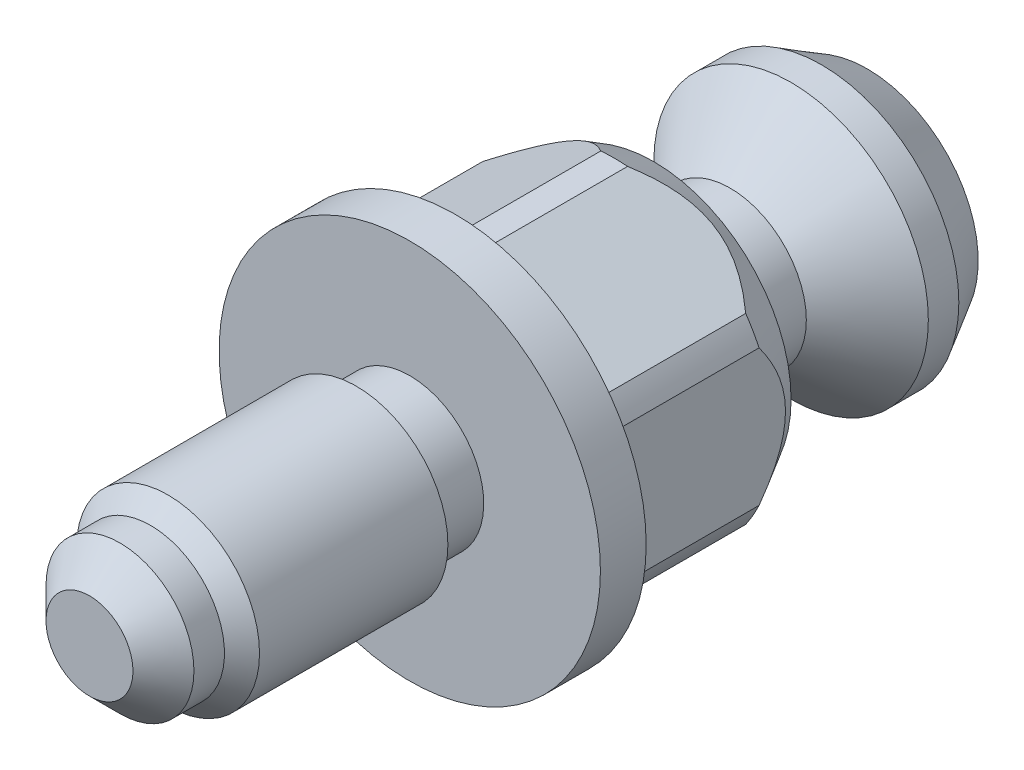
ISO-10303-21;
HEADER;
FILE_DESCRIPTION(('STEP AP214'),'2;1');
FILE_NAME('part.step','',(''),(''),'','','');
FILE_SCHEMA(('AUTOMOTIVE_DESIGN { 1 0 10303 214 1 1 1 1 }'));
ENDSEC;
DATA;
#1=APPLICATION_CONTEXT('core data for automotive mechanical design processes');
#2=APPLICATION_PROTOCOL_DEFINITION('international standard','automotive_design',2000,#1);
#3=PRODUCT_CONTEXT('',#1,'mechanical');
#4=PRODUCT('Part','Part','',(#3));
#5=PRODUCT_RELATED_PRODUCT_CATEGORY('part','',(#4));
#6=PRODUCT_DEFINITION_FORMATION('','',#4);
#7=PRODUCT_DEFINITION_CONTEXT('part definition',#1,'design');
#8=PRODUCT_DEFINITION('design','',#6,#7);
#9=PRODUCT_DEFINITION_SHAPE('','',#8);
#10=(LENGTH_UNIT() NAMED_UNIT(*) SI_UNIT(.MILLI.,.METRE.));
#11=(NAMED_UNIT(*) PLANE_ANGLE_UNIT() SI_UNIT($,.RADIAN.));
#12=(NAMED_UNIT(*) SI_UNIT($,.STERADIAN.) SOLID_ANGLE_UNIT());
#13=UNCERTAINTY_MEASURE_WITH_UNIT(LENGTH_MEASURE(1.E-05),#10,'distance_accuracy_value','');
#14=(GEOMETRIC_REPRESENTATION_CONTEXT(3) GLOBAL_UNCERTAINTY_ASSIGNED_CONTEXT((#13)) GLOBAL_UNIT_ASSIGNED_CONTEXT((#10,
#11,#12)) REPRESENTATION_CONTEXT('',''));
#15=CARTESIAN_POINT('',(0.,0.,0.));
#16=DIRECTION('',(0.,0.,1.));
#17=DIRECTION('',(1.,0.,0.));
#18=AXIS2_PLACEMENT_3D('',#15,#16,#17);
#19=CARTESIAN_POINT('',(0.,7.267949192,-30.));
#20=DIRECTION('',(0.,0.,-1.));
#21=DIRECTION('',(-1.,0.,0.));
#22=AXIS2_PLACEMENT_3D('',#19,#20,#21);
#23=PLANE('',#22);
#24=CARTESIAN_POINT('',(0.,0.,-30.));
#25=DIRECTION('',(0.,0.,1.));
#26=DIRECTION('',(0.,1.,0.));
#27=AXIS2_PLACEMENT_3D('',#24,#25,#26);
#28=CIRCLE('',#27,7.26794919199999);
#29=CARTESIAN_POINT('',(0.,7.26794919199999,-30.));
#30=VERTEX_POINT('',#29);
#31=EDGE_CURVE('E18',#30,#30,#28,.T.);
#32=ORIENTED_EDGE('',*,*,#31,.F.);
#33=EDGE_LOOP('',(#32));
#34=FACE_BOUND('',#33,.T.);
#35=ADVANCED_FACE('F14',(#34),#23,.T.);
#36=CARTESIAN_POINT('',(0.,0.,-27.));
#37=DIRECTION('',(0.,0.,1.));
#38=DIRECTION('',(0.,1.,0.));
#39=AXIS2_PLACEMENT_3D('',#36,#37,#38);
#40=CONICAL_SURFACE('',#39,9.,0.52359877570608);
#41=ORIENTED_EDGE('',*,*,#31,.T.);
#42=EDGE_LOOP('',(#41));
#43=FACE_BOUND('',#42,.T.);
#44=CARTESIAN_POINT('',(0.,0.,-27.));
#45=DIRECTION('',(0.,0.,1.));
#46=DIRECTION('',(1.,0.,0.));
#47=AXIS2_PLACEMENT_3D('',#44,#45,#46);
#48=CIRCLE('',#47,9.);
#49=CARTESIAN_POINT('',(9.,0.,-27.));
#50=VERTEX_POINT('',#49);
#51=EDGE_CURVE('E158',#50,#50,#48,.T.);
#52=ORIENTED_EDGE('',*,*,#51,.F.);
#53=EDGE_LOOP('',(#52));
#54=FACE_BOUND('',#53,.T.);
#55=ADVANCED_FACE('F503',(#43,#54),#40,.T.);
#56=CARTESIAN_POINT('',(0.,0.,-25.));
#57=DIRECTION('',(0.,0.,1.));
#58=DIRECTION('',(1.,0.,0.));
#59=AXIS2_PLACEMENT_3D('',#56,#57,#58);
#60=CYLINDRICAL_SURFACE('',#59,9.);
#61=ORIENTED_EDGE('',*,*,#51,.T.);
#62=EDGE_LOOP('',(#61));
#63=FACE_BOUND('',#62,.T.);
#64=CARTESIAN_POINT('',(0.,0.,-25.));
#65=DIRECTION('',(0.,0.,-1.));
#66=DIRECTION('',(-1.,0.,0.));
#67=AXIS2_PLACEMENT_3D('',#64,#65,#66);
#68=CIRCLE('',#67,9.);
#69=CARTESIAN_POINT('',(-9.,0.,-25.));
#70=VERTEX_POINT('',#69);
#71=EDGE_CURVE('E155',#70,#70,#68,.F.);
#72=ORIENTED_EDGE('',*,*,#71,.F.);
#73=EDGE_LOOP('',(#72));
#74=FACE_BOUND('',#73,.T.);
#75=ADVANCED_FACE('F494',(#63,#74),#60,.T.);
#76=CARTESIAN_POINT('',(0.,0.,-25.));
#77=DIRECTION('',(0.,0.,-1.));
#78=DIRECTION('',(-1.,0.,0.));
#79=AXIS2_PLACEMENT_3D('',#76,#77,#78);
#80=CONICAL_SURFACE('',#79,9.,0.785398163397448);
#81=CARTESIAN_POINT('',(0.,0.,-21.));
#82=DIRECTION('',(0.,0.,1.));
#83=DIRECTION('',(1.,0.,0.));
#84=AXIS2_PLACEMENT_3D('',#81,#82,#83);
#85=CIRCLE('',#84,5.);
#86=CARTESIAN_POINT('',(5.,0.,-21.));
#87=VERTEX_POINT('',#86);
#88=EDGE_CURVE('E151',#87,#87,#85,.T.);
#89=ORIENTED_EDGE('',*,*,#88,.F.);
#90=EDGE_LOOP('',(#89));
#91=FACE_BOUND('',#90,.T.);
#92=ORIENTED_EDGE('',*,*,#71,.T.);
#93=EDGE_LOOP('',(#92));
#94=FACE_BOUND('',#93,.T.);
#95=ADVANCED_FACE('F486',(#91,#94),#80,.T.);
#96=CARTESIAN_POINT('',(0.,0.,-16.));
#97=DIRECTION('',(0.,0.,1.));
#98=DIRECTION('',(1.,0.,0.));
#99=AXIS2_PLACEMENT_3D('',#96,#97,#98);
#100=CYLINDRICAL_SURFACE('',#99,5.);
#101=ORIENTED_EDGE('',*,*,#88,.T.);
#102=EDGE_LOOP('',(#101));
#103=FACE_BOUND('',#102,.T.);
#104=CARTESIAN_POINT('',(0.,0.,-16.));
#105=DIRECTION('',(0.,0.,1.));
#106=DIRECTION('',(1.,0.,0.));
#107=AXIS2_PLACEMENT_3D('',#104,#105,#106);
#108=CIRCLE('',#107,5.);
#109=CARTESIAN_POINT('',(5.,0.,-16.));
#110=VERTEX_POINT('',#109);
#111=EDGE_CURVE('E154',#110,#110,#108,.T.);
#112=ORIENTED_EDGE('',*,*,#111,.F.);
#113=EDGE_LOOP('',(#112));
#114=FACE_BOUND('',#113,.T.);
#115=ADVANCED_FACE('F478',(#103,#114),#100,.T.);
#116=CARTESIAN_POINT('',(0.,10.5,-16.));
#117=DIRECTION('',(0.,0.,-1.));
#118=DIRECTION('',(-1.,0.,0.));
#119=AXIS2_PLACEMENT_3D('',#116,#117,#118);
#120=PLANE('',#119);
#121=ORIENTED_EDGE('',*,*,#111,.T.);
#122=EDGE_LOOP('',(#121));
#123=FACE_BOUND('',#122,.T.);
#124=CARTESIAN_POINT('',(0.,0.,-16.));
#125=DIRECTION('',(0.,0.,1.));
#126=DIRECTION('',(0.,1.,0.));
#127=AXIS2_PLACEMENT_3D('',#124,#125,#126);
#128=CIRCLE('',#127,9.);
#129=CARTESIAN_POINT('',(0.,9.,-16.));
#130=VERTEX_POINT('',#129);
#131=EDGE_CURVE('E113',#130,#130,#128,.T.);
#132=ORIENTED_EDGE('',*,*,#131,.F.);
#133=EDGE_LOOP('',(#132));
#134=FACE_BOUND('',#133,.T.);
#135=ADVANCED_FACE('F222',(#123,#134),#120,.T.);
#136=CARTESIAN_POINT('',(0.,0.,-13.401923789));
#137=DIRECTION('',(0.,0.,1.));
#138=DIRECTION('',(0.,1.,0.));
#139=AXIS2_PLACEMENT_3D('',#136,#137,#138);
#140=CONICAL_SURFACE('',#139,10.5,0.523598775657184);
#141=CARTESIAN_POINT('',(-9.5,4.47213595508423,-13.4019237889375));
#142=CARTESIAN_POINT('',(-9.5,4.37382675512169,-13.4744417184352));
#143=CARTESIAN_POINT('',(-9.5,4.2745898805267,-13.5456985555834));
#144=CARTESIAN_POINT('',(-9.5,4.07411142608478,-13.6853895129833));
#145=CARTESIAN_POINT('',(-9.5,3.97286931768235,-13.753822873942));
#146=CARTESIAN_POINT('',(-9.5,3.66522846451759,-13.9548774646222));
#147=CARTESIAN_POINT('',(-9.50000000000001,3.4556458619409,-14.0827079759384));
#148=CARTESIAN_POINT('',(-9.49999999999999,3.02334222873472,-14.324509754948));
#149=CARTESIAN_POINT('',(-9.49999999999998,2.8004477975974,-14.4381736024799));
#150=CARTESIAN_POINT('',(-9.50000000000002,2.34527205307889,-14.644235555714));
#151=CARTESIAN_POINT('',(-9.50000000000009,2.1130065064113,-14.7366677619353));
#152=CARTESIAN_POINT('',(-9.49999999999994,1.72470446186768,-14.8669939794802));
#153=CARTESIAN_POINT('',(-9.49999999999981,1.57122965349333,-14.9125553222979));
#154=CARTESIAN_POINT('',(-9.50000000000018,1.26118800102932,-14.9917312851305));
#155=CARTESIAN_POINT('',(-9.50000000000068,1.1046210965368,-15.0253456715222));
#156=CARTESIAN_POINT('',(-9.49999999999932,0.790622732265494,-15.0792867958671));
#157=CARTESIAN_POINT('',(-9.49999999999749,0.633211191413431,-15.0997285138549));
#158=CARTESIAN_POINT('',(-9.50000000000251,0.317204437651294,-15.1270741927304));
#159=CARTESIAN_POINT('',(-9.50000000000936,0.158609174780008,-15.1339775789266));
#160=CARTESIAN_POINT('',(-9.50000000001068,-0.185399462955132,-15.1339711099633));
#161=CARTESIAN_POINT('',(-9.50000000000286,-0.370817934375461,-15.1245311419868));
#162=CARTESIAN_POINT('',(-9.49999999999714,-0.73979790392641,-15.0872441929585));
#163=CARTESIAN_POINT('',(-9.49999999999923,-0.923359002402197,-15.059393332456));
#164=CARTESIAN_POINT('',(-9.50000000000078,-1.28889223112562,-14.9862345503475));
#165=CARTESIAN_POINT('',(-9.50000000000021,-1.47082868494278,-14.94075029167));
#166=CARTESIAN_POINT('',(-9.49999999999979,-1.83003894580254,-14.834260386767));
#167=CARTESIAN_POINT('',(-9.49999999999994,-2.00731280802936,-14.7732549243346));
#168=CARTESIAN_POINT('',(-9.50000000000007,-2.38944082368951,-14.625097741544));
#169=CARTESIAN_POINT('',(-9.50000000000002,-2.5932192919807,-14.5351870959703));
#170=CARTESIAN_POINT('',(-9.49999999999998,-2.99324664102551,-14.3397478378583));
#171=CARTESIAN_POINT('',(-9.49999999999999,-3.18948943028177,-14.2342069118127));
#172=CARTESIAN_POINT('',(-9.50000000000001,-3.57066602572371,-14.0127910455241));
#173=CARTESIAN_POINT('',(-9.5,-3.75574854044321,-13.8971694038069));
#174=CARTESIAN_POINT('',(-9.5,-4.11892212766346,-13.6562794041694));
#175=CARTESIAN_POINT('',(-9.49999999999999,-4.29702861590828,-13.5310343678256));
#176=CARTESIAN_POINT('',(-9.5,-4.47213595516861,-13.4019237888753));
#177=B_SPLINE_CURVE_WITH_KNOTS('',3,(#141,#142,#143,#144,#145,#146,#147,#148,#149,#150,#151,
#152,#153,#154,#155,#156,#157,#158,#159,#160,#161,#162,#163,#164,#165,#166,#167,#168,#169,#170,
#171,#172,#173,#174,#175,#176),.UNSPECIFIED.,.F.,.F.,(4,2,2,2,2,2,2,2,2,2,2,2,2,2,2,2,2,4),(0.,
0.36646655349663,0.733031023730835,1.46889072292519,2.21865100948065,2.96719853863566,
3.44707289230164,3.92695662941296,4.40259274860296,4.87824905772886,5.43424731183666,
5.99036276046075,6.55218920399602,7.1140089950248,7.78138203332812,8.44928365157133,
9.10362569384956,9.75642918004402),.UNSPECIFIED.);
#178=CARTESIAN_POINT('',(-9.5,4.4721359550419,-13.4019237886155));
#179=VERTEX_POINT('',#178);
#180=CARTESIAN_POINT('',(-9.5,-4.47213595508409,-13.4019237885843));
#181=VERTEX_POINT('',#180);
#182=EDGE_CURVE('E143',#179,#181,#177,.T.);
#183=ORIENTED_EDGE('',*,*,#182,.F.);
#184=CARTESIAN_POINT('',(0.,0.,-13.4019237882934));
#185=DIRECTION('',(0.,0.,1.));
#186=DIRECTION('',(1.,0.,0.));
#187=AXIS2_PLACEMENT_3D('',#184,#185,#186);
#188=CIRCLE('',#187,10.5);
#189=CARTESIAN_POINT('',(-8.62298334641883,5.99117335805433,-13.4019237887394));
#190=VERTEX_POINT('',#189);
#191=EDGE_CURVE('E144',#190,#179,#188,.T.);
#192=ORIENTED_EDGE('',*,*,#191,.F.);
#193=CARTESIAN_POINT('',(-0.877016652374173,10.463309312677,-13.4019237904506));
#194=CARTESIAN_POINT('',(-0.962161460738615,10.4141509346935,-13.4744472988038));
#195=CARTESIAN_POINT('',(-1.04810979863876,10.3645286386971,-13.5457095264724));
#196=CARTESIAN_POINT('',(-1.22174284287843,10.2642815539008,-13.6854107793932));
#197=CARTESIAN_POINT('',(-1.3094280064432,10.2136565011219,-13.7538490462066));
#198=CARTESIAN_POINT('',(-1.57587049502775,10.0598258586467,-13.9549149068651));
#199=CARTESIAN_POINT('',(-1.75738537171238,9.9550281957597,-14.0827512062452));
#200=CARTESIAN_POINT('',(-2.1317699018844,9.73887718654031,-14.3245462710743));
#201=CARTESIAN_POINT('',(-2.3247886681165,9.62743774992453,-14.4381997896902));
#202=CARTESIAN_POINT('',(-2.7189565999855,9.39986478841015,-14.6442456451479));
#203=CARTESIAN_POINT('',(-2.92009228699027,9.28373904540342,-14.7366716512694));
#204=CARTESIAN_POINT('',(-3.25947795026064,9.08779464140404,-14.868201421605));
#205=CARTESIAN_POINT('',(-3.39558242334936,9.00921468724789,-14.9147138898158));
#206=CARTESIAN_POINT('',(-3.67058705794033,8.8504406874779,-14.9951881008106));
#207=CARTESIAN_POINT('',(-3.80948732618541,8.77024658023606,-15.0291493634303));
#208=CARTESIAN_POINT('',(-4.08805651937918,8.60941458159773,-15.0831094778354));
#209=CARTESIAN_POINT('',(-4.22770769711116,8.5287869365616,-15.1032295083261));
#210=CARTESIAN_POINT('',(-4.50800372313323,8.36695795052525,-15.1292386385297));
#211=CARTESIAN_POINT('',(-4.6486485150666,8.28575664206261,-15.1351285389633));
#212=CARTESIAN_POINT('',(-4.93008837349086,8.12326726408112,-15.1324438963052));
#213=CARTESIAN_POINT('',(-5.07088325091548,8.04197930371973,-15.1238431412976));
#214=CARTESIAN_POINT('',(-5.35127860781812,7.88009296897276,-15.0924656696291));
#215=CARTESIAN_POINT('',(-5.49087901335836,7.79949463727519,-15.0696880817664));
#216=CARTESIAN_POINT('',(-5.76916989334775,7.63882332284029,-15.0105335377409));
#217=CARTESIAN_POINT('',(-5.90784118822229,7.55876141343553,-14.9740372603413));
#218=CARTESIAN_POINT('',(-6.18226449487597,7.40032304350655,-14.8886972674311));
#219=CARTESIAN_POINT('',(-6.31801659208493,7.32194653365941,-14.8398539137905));
#220=CARTESIAN_POINT('',(-6.64960867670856,7.13050175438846,-14.7054936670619));
#221=CARTESIAN_POINT('',(-6.84350226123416,7.01855724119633,-14.6135573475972));
#222=CARTESIAN_POINT('',(-7.22365864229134,6.79907385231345,-14.410233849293));
#223=CARTESIAN_POINT('',(-7.40991048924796,6.69154129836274,-14.2988198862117));
#224=CARTESIAN_POINT('',(-7.77139196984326,6.48283986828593,-14.0627424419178));
#225=CARTESIAN_POINT('',(-7.9467620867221,6.38158988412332,-13.9383635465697));
#226=CARTESIAN_POINT('',(-8.2044002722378,6.23284240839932,-13.7431105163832));
#227=CARTESIAN_POINT('',(-8.28924260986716,6.18385866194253,-13.6766942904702));
#228=CARTESIAN_POINT('',(-8.45730217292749,6.08682942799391,-13.5412207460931));
#229=CARTESIAN_POINT('',(-8.5405197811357,6.03878371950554,-13.472164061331));
#230=CARTESIAN_POINT('',(-8.62298334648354,5.99117335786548,-13.4019237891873));
#231=B_SPLINE_CURVE_WITH_KNOTS('',3,(#193,#194,#195,#196,#197,#198,#199,#200,#201,#202,#203,
#204,#205,#206,#207,#208,#209,#210,#211,#212,#213,#214,#215,#216,#217,#218,#219,#220,#221,#222,
#223,#224,#225,#226,#227,#228,#229,#230),.UNSPECIFIED.,.F.,.F.,(4,2,2,2,2,2,2,2,2,2,2,2,2,2,2,2,
2,2,4),(0.,0.366494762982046,0.733087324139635,1.4689888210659,2.21869243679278,
2.96719859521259,3.45845087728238,3.94972195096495,4.43663529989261,4.9235212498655,
5.41128886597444,5.89908645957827,6.39122881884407,6.88335675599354,7.60823451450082,
8.3341170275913,9.04651481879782,9.40155540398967,9.75651130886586),.UNSPECIFIED.);
#232=CARTESIAN_POINT('',(-0.877016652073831,10.4633093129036,-13.4019237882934));
#233=VERTEX_POINT('',#232);
#234=EDGE_CURVE('E148',#233,#190,#231,.T.);
#235=ORIENTED_EDGE('',*,*,#234,.F.);
#236=CARTESIAN_POINT('',(0.,0.,-13.4019237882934));
#237=DIRECTION('',(0.,0.,1.));
#238=DIRECTION('',(1.,0.,0.));
#239=AXIS2_PLACEMENT_3D('',#236,#237,#238);
#240=CIRCLE('',#239,10.5);
#241=CARTESIAN_POINT('',(0.877016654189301,10.4633093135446,-13.4019237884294));
#242=VERTEX_POINT('',#241);
#243=EDGE_CURVE('E109',#242,#233,#240,.T.);
#244=ORIENTED_EDGE('',*,*,#243,.F.);
#245=CARTESIAN_POINT('',(8.6229833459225,5.99117335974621,-13.4019237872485));
#246=CARTESIAN_POINT('',(8.53783853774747,6.04033173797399,-13.4744472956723));
#247=CARTESIAN_POINT('',(8.45189019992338,6.08995403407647,-13.5457095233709));
#248=CARTESIAN_POINT('',(8.27825715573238,6.19020111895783,-13.6854107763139));
#249=CARTESIAN_POINT('',(8.1905719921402,6.24082617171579,-13.7538490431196));
#250=CARTESIAN_POINT('',(7.92412950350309,6.39465681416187,-13.9549149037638));
#251=CARTESIAN_POINT('',(7.74261462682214,6.49945447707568,-14.0827512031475));
#252=CARTESIAN_POINT('',(7.36823009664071,6.71560548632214,-14.324546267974));
#253=CARTESIAN_POINT('',(7.17521133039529,6.82704492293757,-14.438199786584));
#254=CARTESIAN_POINT('',(6.78104339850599,7.05461788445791,-14.6442456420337));
#255=CARTESIAN_POINT('',(6.5799077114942,7.17074362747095,-14.7366716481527));
#256=CARTESIAN_POINT('',(6.24052204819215,7.36668803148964,-14.8682014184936));
#257=CARTESIAN_POINT('',(6.10441757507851,7.44526798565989,-14.9147138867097));
#258=CARTESIAN_POINT('',(5.82941294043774,7.60404198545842,-14.9951880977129));
#259=CARTESIAN_POINT('',(5.69051267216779,7.6842360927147,-15.0291493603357));
#260=CARTESIAN_POINT('',(5.41194347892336,7.84506809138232,-15.0831094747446));
#261=CARTESIAN_POINT('',(5.2722923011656,7.92569573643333,-15.103229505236));
#262=CARTESIAN_POINT('',(4.99199627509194,8.08752472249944,-15.1292386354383));
#263=CARTESIAN_POINT('',(4.85135148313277,8.16872603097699,-15.13512853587));
#264=CARTESIAN_POINT('',(4.56991162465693,8.33121540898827,-15.1324438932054));
#265=CARTESIAN_POINT('',(4.42911674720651,8.41250336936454,-15.1238431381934));
#266=CARTESIAN_POINT('',(4.14872139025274,8.57438970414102,-15.0924656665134));
#267=CARTESIAN_POINT('',(4.00912098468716,8.65498803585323,-15.0696880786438));
#268=CARTESIAN_POINT('',(3.73083010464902,8.81565935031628,-15.0105335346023));
#269=CARTESIAN_POINT('',(3.59215880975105,8.89572125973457,-14.9740372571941));
#270=CARTESIAN_POINT('',(3.31773550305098,9.05415962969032,-14.8886972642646));
#271=CARTESIAN_POINT('',(3.18198340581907,9.13253613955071,-14.8398539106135));
#272=CARTESIAN_POINT('',(2.85039132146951,9.32398091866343,-14.7054936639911));
#273=CARTESIAN_POINT('',(2.65649773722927,9.43592543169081,-14.6135573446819));
#274=CARTESIAN_POINT('',(2.27634135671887,9.65540882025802,-14.4102338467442));
#275=CARTESIAN_POINT('',(2.09008951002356,9.76294137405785,-14.2988198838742));
#276=CARTESIAN_POINT('',(1.72860802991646,9.9716428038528,-14.0627424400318));
#277=CARTESIAN_POINT('',(1.55323791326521,10.072892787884,-13.9383635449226));
#278=CARTESIAN_POINT('',(1.29559972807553,10.2216402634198,-13.7431105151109));
#279=CARTESIAN_POINT('',(1.2107573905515,10.2706240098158,-13.6766942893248));
#280=CARTESIAN_POINT('',(1.04269782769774,10.3676532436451,-13.5412207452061));
#281=CARTESIAN_POINT('',(0.959480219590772,10.415698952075,-13.4721640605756));
#282=CARTESIAN_POINT('',(0.87701665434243,10.4633093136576,-13.4019237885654));
#283=B_SPLINE_CURVE_WITH_KNOTS('',3,(#245,#246,#247,#248,#249,#250,#251,#252,#253,#254,#255,
#256,#257,#258,#259,#260,#261,#262,#263,#264,#265,#266,#267,#268,#269,#270,#271,#272,#273,#274,
#275,#276,#277,#278,#279,#280,#281,#282),.UNSPECIFIED.,.F.,.F.,(4,2,2,2,2,2,2,2,2,2,2,2,2,2,2,2,
2,2,4),(0.,0.366494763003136,0.733087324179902,1.46898882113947,2.21869243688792,
2.96719859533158,3.45845087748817,3.94972195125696,4.43663530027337,4.92352125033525,
5.41128886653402,5.89908646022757,6.3912288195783,6.88335675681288,7.6082345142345,
8.33411702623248,9.04651481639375,9.40155540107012,9.75651130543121),.UNSPECIFIED.);
#284=CARTESIAN_POINT('',(8.62298334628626,5.99117335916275,-13.4019237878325));
#285=VERTEX_POINT('',#284);
#286=EDGE_CURVE('E102',#285,#242,#283,.T.);
#287=ORIENTED_EDGE('',*,*,#286,.F.);
#288=CARTESIAN_POINT('',(0.,0.,-13.4019237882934));
#289=DIRECTION('',(0.,0.,1.));
#290=DIRECTION('',(1.,0.,0.));
#291=AXIS2_PLACEMENT_3D('',#288,#289,#290);
#292=CIRCLE('',#291,10.5);
#293=CARTESIAN_POINT('',(9.5,4.47213595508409,-13.4019237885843));
#294=VERTEX_POINT('',#293);
#295=EDGE_CURVE('E107',#294,#285,#292,.T.);
#296=ORIENTED_EDGE('',*,*,#295,.F.);
#297=CARTESIAN_POINT('',(9.5,-4.47213595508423,-13.4019237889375));
#298=CARTESIAN_POINT('',(9.5,-4.37382675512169,-13.4744417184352));
#299=CARTESIAN_POINT('',(9.5,-4.2745898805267,-13.5456985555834));
#300=CARTESIAN_POINT('',(9.5,-4.07411142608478,-13.6853895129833));
#301=CARTESIAN_POINT('',(9.5,-3.97286931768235,-13.753822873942));
#302=CARTESIAN_POINT('',(9.5,-3.66522846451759,-13.9548774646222));
#303=CARTESIAN_POINT('',(9.50000000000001,-3.4556458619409,-14.0827079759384));
#304=CARTESIAN_POINT('',(9.49999999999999,-3.02334222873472,-14.324509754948));
#305=CARTESIAN_POINT('',(9.49999999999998,-2.8004477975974,-14.4381736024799));
#306=CARTESIAN_POINT('',(9.50000000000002,-2.34527205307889,-14.644235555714));
#307=CARTESIAN_POINT('',(9.50000000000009,-2.1130065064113,-14.7366677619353));
#308=CARTESIAN_POINT('',(9.49999999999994,-1.72470446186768,-14.8669939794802));
#309=CARTESIAN_POINT('',(9.49999999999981,-1.57122965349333,-14.9125553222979));
#310=CARTESIAN_POINT('',(9.50000000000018,-1.26118800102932,-14.9917312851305));
#311=CARTESIAN_POINT('',(9.50000000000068,-1.1046210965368,-15.0253456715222));
#312=CARTESIAN_POINT('',(9.49999999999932,-0.790622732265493,-15.0792867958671));
#313=CARTESIAN_POINT('',(9.49999999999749,-0.633211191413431,-15.0997285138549));
#314=CARTESIAN_POINT('',(9.50000000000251,-0.317204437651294,-15.1270741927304));
#315=CARTESIAN_POINT('',(9.50000000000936,-0.158609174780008,-15.1339775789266));
#316=CARTESIAN_POINT('',(9.50000000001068,0.185399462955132,-15.1339711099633));
#317=CARTESIAN_POINT('',(9.50000000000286,0.37081793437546,-15.1245311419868));
#318=CARTESIAN_POINT('',(9.49999999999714,0.739797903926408,-15.0872441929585));
#319=CARTESIAN_POINT('',(9.49999999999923,0.923359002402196,-15.059393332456));
#320=CARTESIAN_POINT('',(9.50000000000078,1.28889223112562,-14.9862345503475));
#321=CARTESIAN_POINT('',(9.50000000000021,1.47082868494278,-14.94075029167));
#322=CARTESIAN_POINT('',(9.49999999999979,1.83003894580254,-14.834260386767));
#323=CARTESIAN_POINT('',(9.49999999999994,2.00731280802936,-14.7732549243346));
#324=CARTESIAN_POINT('',(9.50000000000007,2.3894408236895,-14.625097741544));
#325=CARTESIAN_POINT('',(9.50000000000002,2.5932192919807,-14.5351870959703));
#326=CARTESIAN_POINT('',(9.49999999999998,2.99324664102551,-14.3397478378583));
#327=CARTESIAN_POINT('',(9.49999999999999,3.18948943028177,-14.2342069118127));
#328=CARTESIAN_POINT('',(9.50000000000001,3.57066602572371,-14.0127910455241));
#329=CARTESIAN_POINT('',(9.5,3.75574854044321,-13.8971694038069));
#330=CARTESIAN_POINT('',(9.5,4.11892212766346,-13.6562794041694));
#331=CARTESIAN_POINT('',(9.49999999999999,4.29702861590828,-13.5310343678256));
#332=CARTESIAN_POINT('',(9.5,4.47213595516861,-13.4019237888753));
#333=B_SPLINE_CURVE_WITH_KNOTS('',3,(#297,#298,#299,#300,#301,#302,#303,#304,#305,#306,#307,
#308,#309,#310,#311,#312,#313,#314,#315,#316,#317,#318,#319,#320,#321,#322,#323,#324,#325,#326,
#327,#328,#329,#330,#331,#332),.UNSPECIFIED.,.F.,.F.,(4,2,2,2,2,2,2,2,2,2,2,2,2,2,2,2,2,4),(0.,
0.36646655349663,0.733031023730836,1.46889072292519,2.21865100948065,2.96719853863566,
3.44707289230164,3.92695662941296,4.40259274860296,4.87824905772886,5.43424731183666,
5.99036276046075,6.55218920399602,7.11400899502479,7.78138203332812,8.44928365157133,
9.10362569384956,9.75642918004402),.UNSPECIFIED.);
#334=CARTESIAN_POINT('',(9.5,-4.4721359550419,-13.4019237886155));
#335=VERTEX_POINT('',#334);
#336=EDGE_CURVE('E124',#335,#294,#333,.T.);
#337=ORIENTED_EDGE('',*,*,#336,.F.);
#338=CARTESIAN_POINT('',(0.,0.,-13.4019237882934));
#339=DIRECTION('',(0.,0.,1.));
#340=DIRECTION('',(1.,0.,0.));
#341=AXIS2_PLACEMENT_3D('',#338,#339,#340);
#342=CIRCLE('',#341,10.5);
#343=CARTESIAN_POINT('',(8.62298334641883,-5.99117335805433,-13.4019237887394));
#344=VERTEX_POINT('',#343);
#345=EDGE_CURVE('E131',#344,#335,#342,.T.);
#346=ORIENTED_EDGE('',*,*,#345,.F.);
#347=CARTESIAN_POINT('',(0.877016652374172,-10.463309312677,-13.4019237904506));
#348=CARTESIAN_POINT('',(0.962161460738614,-10.4141509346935,-13.4744472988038));
#349=CARTESIAN_POINT('',(1.04810979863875,-10.3645286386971,-13.5457095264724));
#350=CARTESIAN_POINT('',(1.22174284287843,-10.2642815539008,-13.6854107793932));
#351=CARTESIAN_POINT('',(1.3094280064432,-10.2136565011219,-13.7538490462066));
#352=CARTESIAN_POINT('',(1.57587049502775,-10.0598258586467,-13.9549149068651));
#353=CARTESIAN_POINT('',(1.75738537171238,-9.9550281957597,-14.0827512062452));
#354=CARTESIAN_POINT('',(2.1317699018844,-9.73887718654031,-14.3245462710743));
#355=CARTESIAN_POINT('',(2.3247886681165,-9.62743774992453,-14.4381997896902));
#356=CARTESIAN_POINT('',(2.7189565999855,-9.39986478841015,-14.6442456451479));
#357=CARTESIAN_POINT('',(2.92009228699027,-9.28373904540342,-14.7366716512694));
#358=CARTESIAN_POINT('',(3.25947795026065,-9.08779464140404,-14.868201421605));
#359=CARTESIAN_POINT('',(3.39558242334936,-9.00921468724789,-14.9147138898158));
#360=CARTESIAN_POINT('',(3.67058705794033,-8.8504406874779,-14.9951881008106));
#361=CARTESIAN_POINT('',(3.80948732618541,-8.77024658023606,-15.0291493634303));
#362=CARTESIAN_POINT('',(4.08805651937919,-8.60941458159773,-15.0831094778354));
#363=CARTESIAN_POINT('',(4.22770769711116,-8.5287869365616,-15.1032295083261));
#364=CARTESIAN_POINT('',(4.50800372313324,-8.36695795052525,-15.1292386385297));
#365=CARTESIAN_POINT('',(4.64864851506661,-8.28575664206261,-15.1351285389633));
#366=CARTESIAN_POINT('',(4.93008837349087,-8.12326726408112,-15.1324438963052));
#367=CARTESIAN_POINT('',(5.07088325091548,-8.04197930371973,-15.1238431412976));
#368=CARTESIAN_POINT('',(5.35127860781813,-7.88009296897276,-15.0924656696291));
#369=CARTESIAN_POINT('',(5.49087901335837,-7.79949463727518,-15.0696880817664));
#370=CARTESIAN_POINT('',(5.76916989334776,-7.63882332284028,-15.0105335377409));
#371=CARTESIAN_POINT('',(5.9078411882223,-7.55876141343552,-14.9740372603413));
#372=CARTESIAN_POINT('',(6.18226449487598,-7.40032304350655,-14.8886972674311));
#373=CARTESIAN_POINT('',(6.31801659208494,-7.32194653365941,-14.8398539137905));
#374=CARTESIAN_POINT('',(6.64960867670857,-7.13050175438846,-14.7054936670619));
#375=CARTESIAN_POINT('',(6.84350226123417,-7.01855724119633,-14.6135573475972));
#376=CARTESIAN_POINT('',(7.22365864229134,-6.79907385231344,-14.410233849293));
#377=CARTESIAN_POINT('',(7.40991048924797,-6.69154129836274,-14.2988198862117));
#378=CARTESIAN_POINT('',(7.77139196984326,-6.48283986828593,-14.0627424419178));
#379=CARTESIAN_POINT('',(7.9467620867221,-6.38158988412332,-13.9383635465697));
#380=CARTESIAN_POINT('',(8.2044002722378,-6.23284240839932,-13.7431105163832));
#381=CARTESIAN_POINT('',(8.28924260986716,-6.18385866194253,-13.6766942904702));
#382=CARTESIAN_POINT('',(8.45730217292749,-6.0868294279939,-13.5412207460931));
#383=CARTESIAN_POINT('',(8.5405197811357,-6.03878371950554,-13.472164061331));
#384=CARTESIAN_POINT('',(8.62298334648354,-5.99117335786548,-13.4019237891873));
#385=B_SPLINE_CURVE_WITH_KNOTS('',3,(#347,#348,#349,#350,#351,#352,#353,#354,#355,#356,#357,
#358,#359,#360,#361,#362,#363,#364,#365,#366,#367,#368,#369,#370,#371,#372,#373,#374,#375,#376,
#377,#378,#379,#380,#381,#382,#383,#384),.UNSPECIFIED.,.F.,.F.,(4,2,2,2,2,2,2,2,2,2,2,2,2,2,2,2,
2,2,4),(0.,0.366494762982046,0.733087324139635,1.4689888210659,2.21869243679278,
2.96719859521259,3.45845087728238,3.94972195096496,4.43663529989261,4.92352124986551,
5.41128886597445,5.89908645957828,6.39122881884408,6.88335675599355,7.60823451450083,
8.3341170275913,9.04651481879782,9.40155540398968,9.75651130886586),.UNSPECIFIED.);
#386=CARTESIAN_POINT('',(0.877016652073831,-10.4633093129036,-13.4019237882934));
#387=VERTEX_POINT('',#386);
#388=EDGE_CURVE('E135',#387,#344,#385,.T.);
#389=ORIENTED_EDGE('',*,*,#388,.F.);
#390=CARTESIAN_POINT('',(0.,0.,-13.4019237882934));
#391=DIRECTION('',(0.,0.,1.));
#392=DIRECTION('',(1.,0.,0.));
#393=AXIS2_PLACEMENT_3D('',#390,#391,#392);
#394=CIRCLE('',#393,10.5);
#395=CARTESIAN_POINT('',(-0.877016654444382,-10.4633093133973,-13.4019237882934));
#396=VERTEX_POINT('',#395);
#397=EDGE_CURVE('E136',#396,#387,#394,.T.);
#398=ORIENTED_EDGE('',*,*,#397,.F.);
#399=CARTESIAN_POINT('',(-8.62298334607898,-5.99117336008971,-13.4019237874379));
#400=CARTESIAN_POINT('',(-8.53783853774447,-6.04033173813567,-13.4744472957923));
#401=CARTESIAN_POINT('',(-8.45189019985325,-6.08995403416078,-13.5457095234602));
#402=CARTESIAN_POINT('',(-8.27825715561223,-6.19020111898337,-13.6854107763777));
#403=CARTESIAN_POINT('',(-8.19057199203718,-6.24082617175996,-13.7538490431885));
#404=CARTESIAN_POINT('',(-7.92412950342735,-6.39465681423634,-13.9549149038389));
#405=CARTESIAN_POINT('',(-7.74261462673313,-6.49945447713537,-14.0827512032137));
#406=CARTESIAN_POINT('',(-7.36823009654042,-6.71560548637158,-14.3245462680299));
#407=CARTESIAN_POINT('',(-7.17521133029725,-6.82704492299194,-14.4381997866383));
#408=CARTESIAN_POINT('',(-6.78104339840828,-7.05461788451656,-14.6442456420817));
#409=CARTESIAN_POINT('',(-6.5799077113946,-7.17074362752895,-14.7366716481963));
#410=CARTESIAN_POINT('',(-6.24052204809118,-7.36668803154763,-14.8682014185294));
#411=CARTESIAN_POINT('',(-6.10441757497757,-7.44526798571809,-14.9147138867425));
#412=CARTESIAN_POINT('',(-5.82941294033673,-7.60404198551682,-14.9951880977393));
#413=CARTESIAN_POINT('',(-5.69051267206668,-7.6842360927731,-15.0291493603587));
#414=CARTESIAN_POINT('',(-5.41194347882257,-7.84506809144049,-15.0831094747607));
#415=CARTESIAN_POINT('',(-5.27229230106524,-7.92569573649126,-15.1032295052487));
#416=CARTESIAN_POINT('',(-4.99199627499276,-8.08752472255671,-15.1292386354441));
#417=CARTESIAN_POINT('',(-4.85135148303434,-8.16872603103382,-15.1351285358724));
#418=CARTESIAN_POINT('',(-4.56991162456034,-8.33121540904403,-15.1324438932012));
#419=CARTESIAN_POINT('',(-4.42911674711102,-8.41250336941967,-15.1238431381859));
#420=CARTESIAN_POINT('',(-4.14872139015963,-8.57438970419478,-15.0924656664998));
#421=CARTESIAN_POINT('',(-4.00912098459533,-8.65498803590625,-15.0696880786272));
#422=CARTESIAN_POINT('',(-3.7308301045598,-8.81565935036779,-15.0105335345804));
#423=CARTESIAN_POINT('',(-3.59215880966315,-8.89572125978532,-14.9740372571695));
#424=CARTESIAN_POINT('',(-3.31773550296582,-9.05415962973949,-14.8886972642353));
#425=CARTESIAN_POINT('',(-3.18198340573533,-9.13253613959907,-14.8398539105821));
#426=CARTESIAN_POINT('',(-2.85039132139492,-9.3239809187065,-14.7054936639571));
#427=CARTESIAN_POINT('',(-2.65649773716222,-9.43592543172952,-14.6135573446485));
#428=CARTESIAN_POINT('',(-2.27634135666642,-9.65540882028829,-14.4102338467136));
#429=CARTESIAN_POINT('',(-2.09008950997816,-9.76294137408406,-14.298819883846));
#430=CARTESIAN_POINT('',(-1.72860802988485,-9.97164280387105,-14.0627424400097));
#431=CARTESIAN_POINT('',(-1.55323791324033,-10.0728927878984,-13.9383635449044));
#432=CARTESIAN_POINT('',(-1.29559972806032,-10.2216402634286,-13.7431105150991));
#433=CARTESIAN_POINT('',(-1.21075739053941,-10.2706240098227,-13.6766942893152));
#434=CARTESIAN_POINT('',(-1.04269782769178,-10.3676532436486,-13.5412207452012));
#435=CARTESIAN_POINT('',(-0.959480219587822,-10.4156989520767,-13.4721640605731));
#436=CARTESIAN_POINT('',(-0.877016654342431,-10.4633093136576,-13.4019237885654));
#437=B_SPLINE_CURVE_WITH_KNOTS('',3,(#399,#400,#401,#402,#403,#404,#405,#406,#407,#408,#409,
#410,#411,#412,#413,#414,#415,#416,#417,#418,#419,#420,#421,#422,#423,#424,#425,#426,#427,#428,
#429,#430,#431,#432,#433,#434,#435,#436),.UNSPECIFIED.,.F.,.F.,(4,2,2,2,2,2,2,2,2,2,2,2,2,2,2,2,
2,2,4),(0.,0.366494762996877,0.733087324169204,1.46898882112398,2.21869243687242,
2.96719859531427,3.45845087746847,3.94972195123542,4.43663530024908,4.92352125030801,
5.41128886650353,5.89908646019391,6.39122881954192,6.88335675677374,7.60823451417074,
8.33411702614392,9.04651481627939,9.40155540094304,9.75651130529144),.UNSPECIFIED.);
#438=CARTESIAN_POINT('',(-8.62298334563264,-5.99117336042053,-13.4019237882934));
#439=VERTEX_POINT('',#438);
#440=EDGE_CURVE('E139',#439,#396,#437,.T.);
#441=ORIENTED_EDGE('',*,*,#440,.F.);
#442=CARTESIAN_POINT('',(0.,0.,-13.4019237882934));
#443=DIRECTION('',(0.,0.,1.));
#444=DIRECTION('',(1.,0.,0.));
#445=AXIS2_PLACEMENT_3D('',#442,#443,#444);
#446=CIRCLE('',#445,10.5);
#447=EDGE_CURVE('E140',#181,#439,#446,.T.);
#448=ORIENTED_EDGE('',*,*,#447,.F.);
#449=EDGE_LOOP('',(#183,#192,#235,#244,#287,#296,#337,#346,#389,#398,#441,#448));
#450=FACE_BOUND('',#449,.T.);
#451=ORIENTED_EDGE('',*,*,#131,.T.);
#452=EDGE_LOOP('',(#451));
#453=FACE_BOUND('',#452,.T.);
#454=ADVANCED_FACE('F104',(#450,#453),#140,.T.);
#455=CARTESIAN_POINT('',(0.,10.969655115,32.355339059));
#456=DIRECTION('',(0.499999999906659,0.866025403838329,0.));
#457=DIRECTION('',(0.866025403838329,-0.499999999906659,0.));
#458=AXIS2_PLACEMENT_3D('',#455,#456,#457);
#459=PLANE('',#458);
#460=ORIENTED_EDGE('',*,*,#286,.T.);
#461=DIRECTION('',(0.,0.,-1.));
#462=VECTOR('',#461,1.);
#463=CARTESIAN_POINT('',(0.877016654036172,10.4633093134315,-8.2009618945));
#464=LINE('',#463,#462);
#465=CARTESIAN_POINT('',(0.87701665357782,10.46330931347,-3.));
#466=VERTEX_POINT('',#465);
#467=EDGE_CURVE('E112',#466,#242,#464,.T.);
#468=ORIENTED_EDGE('',*,*,#467,.F.);
#469=DIRECTION('',(-0.866025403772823,0.500000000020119,0.));
#470=VECTOR('',#469,1.);
#471=CARTESIAN_POINT('',(8.622983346,5.991173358,-3.));
#472=LINE('',#471,#470);
#473=CARTESIAN_POINT('',(8.62298334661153,5.99117335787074,-3.));
#474=VERTEX_POINT('',#473);
#475=EDGE_CURVE('E119',#474,#466,#472,.T.);
#476=ORIENTED_EDGE('',*,*,#475,.F.);
#477=DIRECTION('',(0.,0.,1.));
#478=VECTOR('',#477,1.);
#479=CARTESIAN_POINT('',(8.62298334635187,5.99117335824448,-8.2009618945));
#480=LINE('',#479,#478);
#481=EDGE_CURVE('E116',#285,#474,#480,.T.);
#482=ORIENTED_EDGE('',*,*,#481,.F.);
#483=EDGE_LOOP('',(#460,#468,#476,#482));
#484=FACE_BOUND('',#483,.T.);
#485=ADVANCED_FACE('F117',(#484),#459,.T.);
#486=CARTESIAN_POINT('',(0.,0.,-3.));
#487=DIRECTION('',(0.,0.,1.));
#488=DIRECTION('',(1.,0.,0.));
#489=AXIS2_PLACEMENT_3D('',#486,#487,#488);
#490=CYLINDRICAL_SURFACE('',#489,10.5);
#491=ORIENTED_EDGE('',*,*,#243,.T.);
#492=DIRECTION('',(0.,0.,-1.));
#493=VECTOR('',#492,1.);
#494=CARTESIAN_POINT('',(-0.877016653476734,10.4633093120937,32.355339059));
#495=LINE('',#494,#493);
#496=CARTESIAN_POINT('',(-0.877016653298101,10.463309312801,-3.));
#497=VERTEX_POINT('',#496);
#498=EDGE_CURVE('E150',#497,#233,#495,.T.);
#499=ORIENTED_EDGE('',*,*,#498,.F.);
#500=CARTESIAN_POINT('',(0.,0.,-3.));
#501=DIRECTION('',(0.,0.,1.));
#502=DIRECTION('',(1.,0.,0.));
#503=AXIS2_PLACEMENT_3D('',#500,#501,#502);
#504=CIRCLE('',#503,10.5);
#505=EDGE_CURVE('E199',#466,#497,#504,.T.);
#506=ORIENTED_EDGE('',*,*,#505,.F.);
#507=ORIENTED_EDGE('',*,*,#467,.T.);
#508=EDGE_LOOP('',(#491,#499,#506,#507));
#509=FACE_BOUND('',#508,.T.);
#510=ADVANCED_FACE('F452',(#509),#490,.T.);
#511=CARTESIAN_POINT('',(-9.5,5.484827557,32.355339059));
#512=DIRECTION('',(-0.499999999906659,0.866025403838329,0.));
#513=DIRECTION('',(0.866025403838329,0.499999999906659,0.));
#514=AXIS2_PLACEMENT_3D('',#511,#512,#513);
#515=PLANE('',#514);
#516=ORIENTED_EDGE('',*,*,#234,.T.);
#517=DIRECTION('',(0.,0.,-1.));
#518=VECTOR('',#517,1.);
#519=CARTESIAN_POINT('',(-8.62298334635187,5.99117335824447,-8.2009618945));
#520=LINE('',#519,#518);
#521=CARTESIAN_POINT('',(-8.62298334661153,5.99117335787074,-3.));
#522=VERTEX_POINT('',#521);
#523=EDGE_CURVE('E147',#522,#190,#520,.T.);
#524=ORIENTED_EDGE('',*,*,#523,.F.);
#525=DIRECTION('',(-0.866025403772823,-0.500000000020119,0.));
#526=VECTOR('',#525,1.);
#527=CARTESIAN_POINT('',(-0.877016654,10.463309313,-3.));
#528=LINE('',#527,#526);
#529=EDGE_CURVE('E198',#497,#522,#528,.T.);
#530=ORIENTED_EDGE('',*,*,#529,.F.);
#531=ORIENTED_EDGE('',*,*,#498,.T.);
#532=EDGE_LOOP('',(#516,#524,#530,#531));
#533=FACE_BOUND('',#532,.T.);
#534=ADVANCED_FACE('F444',(#533),#515,.T.);
#535=CARTESIAN_POINT('',(0.,0.,-3.));
#536=DIRECTION('',(0.,0.,1.));
#537=DIRECTION('',(1.,0.,0.));
#538=AXIS2_PLACEMENT_3D('',#535,#536,#537);
#539=CYLINDRICAL_SURFACE('',#538,10.5);
#540=CARTESIAN_POINT('',(0.,0.,-3.));
#541=DIRECTION('',(0.,0.,1.));
#542=DIRECTION('',(1.,0.,0.));
#543=AXIS2_PLACEMENT_3D('',#540,#541,#542);
#544=CIRCLE('',#543,10.5);
#545=CARTESIAN_POINT('',(-9.5,4.47213595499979,-3.));
#546=VERTEX_POINT('',#545);
#547=EDGE_CURVE('E195',#522,#546,#544,.T.);
#548=ORIENTED_EDGE('',*,*,#547,.F.);
#549=ORIENTED_EDGE('',*,*,#523,.T.);
#550=ORIENTED_EDGE('',*,*,#191,.T.);
#551=DIRECTION('',(0.,0.,1.));
#552=VECTOR('',#551,1.);
#553=CARTESIAN_POINT('',(-9.5,4.472135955,32.355339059));
#554=LINE('',#553,#552);
#555=EDGE_CURVE('E249',#546,#179,#554,.F.);
#556=ORIENTED_EDGE('',*,*,#555,.F.);
#557=EDGE_LOOP('',(#548,#549,#550,#556));
#558=FACE_BOUND('',#557,.T.);
#559=ADVANCED_FACE('F261',(#558),#539,.T.);
#560=CARTESIAN_POINT('',(-9.5,-5.484827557,32.355339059));
#561=DIRECTION('',(-1.,0.,0.));
#562=DIRECTION('',(0.,0.,1.));
#563=AXIS2_PLACEMENT_3D('',#560,#561,#562);
#564=PLANE('',#563);
#565=ORIENTED_EDGE('',*,*,#182,.T.);
#566=DIRECTION('',(0.,0.,-1.));
#567=VECTOR('',#566,1.);
#568=CARTESIAN_POINT('',(-9.49999999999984,-4.47213595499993,-8.2009618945));
#569=LINE('',#568,#567);
#570=CARTESIAN_POINT('',(-9.5,-4.47213595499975,-3.));
#571=VERTEX_POINT('',#570);
#572=EDGE_CURVE('E142',#571,#181,#569,.T.);
#573=ORIENTED_EDGE('',*,*,#572,.F.);
#574=DIRECTION('',(0.,1.,0.));
#575=VECTOR('',#574,1.);
#576=CARTESIAN_POINT('',(-9.5,12.5,-3.));
#577=LINE('',#576,#575);
#578=EDGE_CURVE('E194',#546,#571,#577,.F.);
#579=ORIENTED_EDGE('',*,*,#578,.F.);
#580=ORIENTED_EDGE('',*,*,#555,.T.);
#581=EDGE_LOOP('',(#565,#573,#579,#580));
#582=FACE_BOUND('',#581,.T.);
#583=ADVANCED_FACE('F255',(#582),#564,.T.);
#584=CARTESIAN_POINT('',(0.,0.,-3.));
#585=DIRECTION('',(0.,0.,1.));
#586=DIRECTION('',(1.,0.,0.));
#587=AXIS2_PLACEMENT_3D('',#584,#585,#586);
#588=CYLINDRICAL_SURFACE('',#587,10.5);
#589=CARTESIAN_POINT('',(0.,0.,-3.));
#590=DIRECTION('',(0.,0.,1.));
#591=DIRECTION('',(1.,0.,0.));
#592=AXIS2_PLACEMENT_3D('',#589,#590,#591);
#593=CIRCLE('',#592,10.5);
#594=CARTESIAN_POINT('',(-8.62298334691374,-5.99117335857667,-3.));
#595=VERTEX_POINT('',#594);
#596=EDGE_CURVE('E191',#571,#595,#593,.T.);
#597=ORIENTED_EDGE('',*,*,#596,.F.);
#598=ORIENTED_EDGE('',*,*,#572,.T.);
#599=ORIENTED_EDGE('',*,*,#447,.T.);
#600=DIRECTION('',(0.,0.,-1.));
#601=VECTOR('',#600,1.);
#602=CARTESIAN_POINT('',(-8.62298334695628,-5.99117335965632,32.355339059));
#603=LINE('',#602,#601);
#604=EDGE_CURVE('E563',#595,#439,#603,.T.);
#605=ORIENTED_EDGE('',*,*,#604,.F.);
#606=EDGE_LOOP('',(#597,#598,#599,#605));
#607=FACE_BOUND('',#606,.T.);
#608=ADVANCED_FACE('F260',(#607),#588,.T.);
#609=CARTESIAN_POINT('',(0.,-10.969655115,32.355339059));
#610=DIRECTION('',(-0.499999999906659,-0.866025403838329,0.));
#611=DIRECTION('',(-0.866025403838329,0.499999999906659,0.));
#612=AXIS2_PLACEMENT_3D('',#609,#610,#611);
#613=PLANE('',#612);
#614=ORIENTED_EDGE('',*,*,#440,.T.);
#615=DIRECTION('',(0.,0.,-1.));
#616=VECTOR('',#615,1.);
#617=CARTESIAN_POINT('',(-0.877016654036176,-10.4633093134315,-8.2009618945));
#618=LINE('',#617,#616);
#619=CARTESIAN_POINT('',(-0.877016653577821,-10.46330931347,-3.));
#620=VERTEX_POINT('',#619);
#621=EDGE_CURVE('E138',#620,#396,#618,.T.);
#622=ORIENTED_EDGE('',*,*,#621,.F.);
#623=DIRECTION('',(0.866025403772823,-0.500000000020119,0.));
#624=VECTOR('',#623,1.);
#625=CARTESIAN_POINT('',(-8.622983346,-5.991173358,-3.));
#626=LINE('',#625,#624);
#627=EDGE_CURVE('E190',#595,#620,#626,.T.);
#628=ORIENTED_EDGE('',*,*,#627,.F.);
#629=ORIENTED_EDGE('',*,*,#604,.T.);
#630=EDGE_LOOP('',(#614,#622,#628,#629));
#631=FACE_BOUND('',#630,.T.);
#632=ADVANCED_FACE('F264',(#631),#613,.T.);
#633=CARTESIAN_POINT('',(0.,0.,-3.));
#634=DIRECTION('',(0.,0.,1.));
#635=DIRECTION('',(1.,0.,0.));
#636=AXIS2_PLACEMENT_3D('',#633,#634,#635);
#637=CYLINDRICAL_SURFACE('',#636,10.5);
#638=CARTESIAN_POINT('',(0.,0.,-3.));
#639=DIRECTION('',(0.,0.,1.));
#640=DIRECTION('',(1.,0.,0.));
#641=AXIS2_PLACEMENT_3D('',#638,#639,#640);
#642=CIRCLE('',#641,10.5);
#643=CARTESIAN_POINT('',(0.877016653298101,-10.463309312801,-3.));
#644=VERTEX_POINT('',#643);
#645=EDGE_CURVE('E187',#620,#644,#642,.T.);
#646=ORIENTED_EDGE('',*,*,#645,.F.);
#647=ORIENTED_EDGE('',*,*,#621,.T.);
#648=ORIENTED_EDGE('',*,*,#397,.T.);
#649=DIRECTION('',(0.,0.,-1.));
#650=VECTOR('',#649,1.);
#651=CARTESIAN_POINT('',(0.877016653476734,-10.4633093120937,32.355339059));
#652=LINE('',#651,#650);
#653=EDGE_CURVE('E566',#644,#387,#652,.T.);
#654=ORIENTED_EDGE('',*,*,#653,.F.);
#655=EDGE_LOOP('',(#646,#647,#648,#654));
#656=FACE_BOUND('',#655,.T.);
#657=ADVANCED_FACE('F269',(#656),#637,.T.);
#658=CARTESIAN_POINT('',(9.5,-5.484827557,32.355339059));
#659=DIRECTION('',(0.499999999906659,-0.866025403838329,0.));
#660=DIRECTION('',(-0.866025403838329,-0.499999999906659,0.));
#661=AXIS2_PLACEMENT_3D('',#658,#659,#660);
#662=PLANE('',#661);
#663=ORIENTED_EDGE('',*,*,#388,.T.);
#664=DIRECTION('',(0.,0.,-1.));
#665=VECTOR('',#664,1.);
#666=CARTESIAN_POINT('',(8.62298334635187,-5.99117335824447,-8.2009618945));
#667=LINE('',#666,#665);
#668=CARTESIAN_POINT('',(8.62298334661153,-5.99117335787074,-3.));
#669=VERTEX_POINT('',#668);
#670=EDGE_CURVE('E134',#669,#344,#667,.T.);
#671=ORIENTED_EDGE('',*,*,#670,.F.);
#672=DIRECTION('',(0.866025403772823,0.500000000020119,0.));
#673=VECTOR('',#672,1.);
#674=CARTESIAN_POINT('',(0.877016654,-10.463309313,-3.));
#675=LINE('',#674,#673);
#676=EDGE_CURVE('E186',#644,#669,#675,.T.);
#677=ORIENTED_EDGE('',*,*,#676,.F.);
#678=ORIENTED_EDGE('',*,*,#653,.T.);
#679=EDGE_LOOP('',(#663,#671,#677,#678));
#680=FACE_BOUND('',#679,.T.);
#681=ADVANCED_FACE('F272',(#680),#662,.T.);
#682=CARTESIAN_POINT('',(0.,0.,-3.));
#683=DIRECTION('',(0.,0.,1.));
#684=DIRECTION('',(1.,0.,0.));
#685=AXIS2_PLACEMENT_3D('',#682,#683,#684);
#686=CYLINDRICAL_SURFACE('',#685,10.5);
#687=CARTESIAN_POINT('',(0.,0.,-3.));
#688=DIRECTION('',(0.,0.,1.));
#689=DIRECTION('',(1.,0.,0.));
#690=AXIS2_PLACEMENT_3D('',#687,#688,#689);
#691=CIRCLE('',#690,10.5);
#692=CARTESIAN_POINT('',(9.5,-4.47213595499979,-3.));
#693=VERTEX_POINT('',#692);
#694=EDGE_CURVE('E183',#669,#693,#691,.T.);
#695=ORIENTED_EDGE('',*,*,#694,.F.);
#696=ORIENTED_EDGE('',*,*,#670,.T.);
#697=ORIENTED_EDGE('',*,*,#345,.T.);
#698=DIRECTION('',(0.,0.,-1.));
#699=VECTOR('',#698,1.);
#700=CARTESIAN_POINT('',(9.5,-4.472135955,32.355339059));
#701=LINE('',#700,#699);
#702=EDGE_CURVE('E126',#693,#335,#701,.T.);
#703=ORIENTED_EDGE('',*,*,#702,.F.);
#704=EDGE_LOOP('',(#695,#696,#697,#703));
#705=FACE_BOUND('',#704,.T.);
#706=ADVANCED_FACE('F276',(#705),#686,.T.);
#707=CARTESIAN_POINT('',(9.5,5.484827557,32.355339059));
#708=DIRECTION('',(1.,0.,0.));
#709=DIRECTION('',(0.,0.,-1.));
#710=AXIS2_PLACEMENT_3D('',#707,#708,#709);
#711=PLANE('',#710);
#712=ORIENTED_EDGE('',*,*,#336,.T.);
#713=DIRECTION('',(0.,0.,-1.));
#714=VECTOR('',#713,1.);
#715=CARTESIAN_POINT('',(9.49999999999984,4.47213595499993,-8.2009618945));
#716=LINE('',#715,#714);
#717=CARTESIAN_POINT('',(9.5,4.47213595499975,-3.));
#718=VERTEX_POINT('',#717);
#719=EDGE_CURVE('E33',#718,#294,#716,.T.);
#720=ORIENTED_EDGE('',*,*,#719,.F.);
#721=DIRECTION('',(0.,1.,0.));
#722=VECTOR('',#721,1.);
#723=CARTESIAN_POINT('',(9.5,12.5,-3.));
#724=LINE('',#723,#722);
#725=EDGE_CURVE('E182',#693,#718,#724,.T.);
#726=ORIENTED_EDGE('',*,*,#725,.F.);
#727=ORIENTED_EDGE('',*,*,#702,.T.);
#728=EDGE_LOOP('',(#712,#720,#726,#727));
#729=FACE_BOUND('',#728,.T.);
#730=ADVANCED_FACE('F214',(#729),#711,.T.);
#731=CARTESIAN_POINT('',(0.,0.,-3.));
#732=DIRECTION('',(0.,0.,1.));
#733=DIRECTION('',(1.,0.,0.));
#734=AXIS2_PLACEMENT_3D('',#731,#732,#733);
#735=CYLINDRICAL_SURFACE('',#734,10.5);
#736=CARTESIAN_POINT('',(0.,0.,-3.));
#737=DIRECTION('',(0.,0.,1.));
#738=DIRECTION('',(1.,0.,0.));
#739=AXIS2_PLACEMENT_3D('',#736,#737,#738);
#740=CIRCLE('',#739,10.5);
#741=EDGE_CURVE('E180',#718,#474,#740,.T.);
#742=ORIENTED_EDGE('',*,*,#741,.F.);
#743=ORIENTED_EDGE('',*,*,#719,.T.);
#744=ORIENTED_EDGE('',*,*,#295,.T.);
#745=ORIENTED_EDGE('',*,*,#481,.T.);
#746=EDGE_LOOP('',(#742,#743,#744,#745));
#747=FACE_BOUND('',#746,.T.);
#748=ADVANCED_FACE('F123',(#747),#735,.T.);
#749=CARTESIAN_POINT('',(0.,12.5,-3.));
#750=DIRECTION('',(0.,0.,-1.));
#751=DIRECTION('',(-1.,0.,0.));
#752=AXIS2_PLACEMENT_3D('',#749,#750,#751);
#753=PLANE('',#752);
#754=ORIENTED_EDGE('',*,*,#725,.T.);
#755=ORIENTED_EDGE('',*,*,#741,.T.);
#756=ORIENTED_EDGE('',*,*,#475,.T.);
#757=ORIENTED_EDGE('',*,*,#505,.T.);
#758=ORIENTED_EDGE('',*,*,#529,.T.);
#759=ORIENTED_EDGE('',*,*,#547,.T.);
#760=ORIENTED_EDGE('',*,*,#578,.T.);
#761=ORIENTED_EDGE('',*,*,#596,.T.);
#762=ORIENTED_EDGE('',*,*,#627,.T.);
#763=ORIENTED_EDGE('',*,*,#645,.T.);
#764=ORIENTED_EDGE('',*,*,#676,.T.);
#765=ORIENTED_EDGE('',*,*,#694,.T.);
#766=EDGE_LOOP('',(#754,#755,#756,#757,#758,#759,#760,#761,#762,#763,#764,#765));
#767=FACE_BOUND('',#766,.T.);
#768=CARTESIAN_POINT('',(0.,0.,-3.));
#769=DIRECTION('',(0.,0.,1.));
#770=DIRECTION('',(1.,0.,0.));
#771=AXIS2_PLACEMENT_3D('',#768,#769,#770);
#772=CIRCLE('',#771,12.5);
#773=CARTESIAN_POINT('',(12.5,0.,-3.));
#774=VERTEX_POINT('',#773);
#775=EDGE_CURVE('E177',#774,#774,#772,.T.);
#776=ORIENTED_EDGE('',*,*,#775,.F.);
#777=EDGE_LOOP('',(#776));
#778=FACE_BOUND('',#777,.T.);
#779=ADVANCED_FACE('F329',(#767,#778),#753,.T.);
#780=CARTESIAN_POINT('',(0.,0.,0.));
#781=DIRECTION('',(0.,0.,1.));
#782=DIRECTION('',(1.,0.,0.));
#783=AXIS2_PLACEMENT_3D('',#780,#781,#782);
#784=CYLINDRICAL_SURFACE('',#783,12.5);
#785=ORIENTED_EDGE('',*,*,#775,.T.);
#786=EDGE_LOOP('',(#785));
#787=FACE_BOUND('',#786,.T.);
#788=CARTESIAN_POINT('',(0.,0.,0.));
#789=DIRECTION('',(0.,0.,1.));
#790=DIRECTION('',(1.,0.,0.));
#791=AXIS2_PLACEMENT_3D('',#788,#789,#790);
#792=CIRCLE('',#791,12.5);
#793=CARTESIAN_POINT('',(12.5,0.,0.));
#794=VERTEX_POINT('',#793);
#795=EDGE_CURVE('E174',#794,#794,#792,.T.);
#796=ORIENTED_EDGE('',*,*,#795,.F.);
#797=EDGE_LOOP('',(#796));
#798=FACE_BOUND('',#797,.T.);
#799=ADVANCED_FACE('F325',(#787,#798),#784,.T.);
#800=CARTESIAN_POINT('',(0.,4.85,0.));
#801=DIRECTION('',(0.,0.,1.));
#802=DIRECTION('',(1.,0.,0.));
#803=AXIS2_PLACEMENT_3D('',#800,#801,#802);
#804=PLANE('',#803);
#805=CARTESIAN_POINT('',(0.,0.,0.));
#806=DIRECTION('',(0.,0.,1.));
#807=DIRECTION('',(0.,1.,0.));
#808=AXIS2_PLACEMENT_3D('',#805,#806,#807);
#809=CIRCLE('',#808,4.85);
#810=CARTESIAN_POINT('',(0.,4.85,0.));
#811=VERTEX_POINT('',#810);
#812=EDGE_CURVE('E171',#811,#811,#809,.T.);
#813=ORIENTED_EDGE('',*,*,#812,.F.);
#814=EDGE_LOOP('',(#813));
#815=FACE_BOUND('',#814,.T.);
#816=ORIENTED_EDGE('',*,*,#795,.T.);
#817=EDGE_LOOP('',(#816));
#818=FACE_BOUND('',#817,.T.);
#819=ADVANCED_FACE('F321',(#815,#818),#804,.T.);
#820=CARTESIAN_POINT('',(0.,4.85,21.));
#821=DIRECTION('',(0.,0.,1.));
#822=DIRECTION('',(1.,0.,0.));
#823=AXIS2_PLACEMENT_3D('',#820,#821,#822);
#824=PLANE('',#823);
#825=CARTESIAN_POINT('',(0.,0.,21.));
#826=DIRECTION('',(0.,0.,-1.));
#827=DIRECTION('',(-1.,0.,0.));
#828=AXIS2_PLACEMENT_3D('',#825,#826,#827);
#829=CIRCLE('',#828,2.8500000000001);
#830=CARTESIAN_POINT('',(-2.8500000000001,0.,21.));
#831=VERTEX_POINT('',#830);
#832=EDGE_CURVE('E168',#831,#831,#829,.T.);
#833=ORIENTED_EDGE('',*,*,#832,.F.);
#834=EDGE_LOOP('',(#833));
#835=FACE_BOUND('',#834,.T.);
#836=ADVANCED_FACE('F317',(#835),#824,.T.);
#837=CARTESIAN_POINT('',(0.,0.,3.5));
#838=DIRECTION('',(0.,0.,1.));
#839=DIRECTION('',(0.,1.,0.));
#840=AXIS2_PLACEMENT_3D('',#837,#838,#839);
#841=CYLINDRICAL_SURFACE('',#840,4.85);
#842=ORIENTED_EDGE('',*,*,#812,.T.);
#843=EDGE_LOOP('',(#842));
#844=FACE_BOUND('',#843,.T.);
#845=CARTESIAN_POINT('',(0.,0.,3.5));
#846=DIRECTION('',(0.,0.,1.));
#847=DIRECTION('',(0.,1.,0.));
#848=AXIS2_PLACEMENT_3D('',#845,#846,#847);
#849=CIRCLE('',#848,4.85);
#850=CARTESIAN_POINT('',(0.,4.85,3.5));
#851=VERTEX_POINT('',#850);
#852=EDGE_CURVE('E165',#851,#851,#849,.T.);
#853=ORIENTED_EDGE('',*,*,#852,.F.);
#854=EDGE_LOOP('',(#853));
#855=FACE_BOUND('',#854,.T.);
#856=ADVANCED_FACE('F311',(#844,#855),#841,.T.);
#857=CARTESIAN_POINT('',(0.,0.,19.));
#858=DIRECTION('',(0.,0.,-1.));
#859=DIRECTION('',(-1.,0.,0.));
#860=AXIS2_PLACEMENT_3D('',#857,#858,#859);
#861=CONICAL_SURFACE('',#860,4.85,0.785398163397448);
#862=CARTESIAN_POINT('',(0.,0.,19.));
#863=DIRECTION('',(0.,0.,1.));
#864=DIRECTION('',(1.,0.,0.));
#865=AXIS2_PLACEMENT_3D('',#862,#863,#864);
#866=CIRCLE('',#865,4.85);
#867=CARTESIAN_POINT('',(4.85,0.,19.));
#868=VERTEX_POINT('',#867);
#869=EDGE_CURVE('E164',#868,#868,#866,.F.);
#870=ORIENTED_EDGE('',*,*,#869,.F.);
#871=EDGE_LOOP('',(#870));
#872=FACE_BOUND('',#871,.T.);
#873=ORIENTED_EDGE('',*,*,#832,.T.);
#874=EDGE_LOOP('',(#873));
#875=FACE_BOUND('',#874,.T.);
#876=ADVANCED_FACE('F302',(#872,#875),#861,.T.);
#877=CARTESIAN_POINT('',(0.,4.85,3.5));
#878=DIRECTION('',(0.,0.,-1.));
#879=DIRECTION('',(-1.,0.,0.));
#880=AXIS2_PLACEMENT_3D('',#877,#878,#879);
#881=PLANE('',#880);
#882=ORIENTED_EDGE('',*,*,#852,.T.);
#883=EDGE_LOOP('',(#882));
#884=FACE_BOUND('',#883,.T.);
#885=CARTESIAN_POINT('',(0.,0.,3.5));
#886=DIRECTION('',(0.,0.,1.));
#887=DIRECTION('',(1.,0.,0.));
#888=AXIS2_PLACEMENT_3D('',#885,#886,#887);
#889=CIRCLE('',#888,6.);
#890=CARTESIAN_POINT('',(6.,0.,3.5));
#891=VERTEX_POINT('',#890);
#892=EDGE_CURVE('E161',#891,#891,#889,.T.);
#893=ORIENTED_EDGE('',*,*,#892,.F.);
#894=EDGE_LOOP('',(#893));
#895=FACE_BOUND('',#894,.T.);
#896=ADVANCED_FACE('F300',(#884,#895),#881,.T.);
#897=CARTESIAN_POINT('',(0.,0.,19.));
#898=DIRECTION('',(0.,0.,1.));
#899=DIRECTION('',(1.,0.,0.));
#900=AXIS2_PLACEMENT_3D('',#897,#898,#899);
#901=CYLINDRICAL_SURFACE('',#900,4.85);
#902=ORIENTED_EDGE('',*,*,#869,.T.);
#903=EDGE_LOOP('',(#902));
#904=FACE_BOUND('',#903,.T.);
#905=CARTESIAN_POINT('',(0.,0.,17.));
#906=DIRECTION('',(0.,0.,-1.));
#907=DIRECTION('',(-1.,0.,0.));
#908=AXIS2_PLACEMENT_3D('',#905,#906,#907);
#909=CIRCLE('',#908,4.85);
#910=CARTESIAN_POINT('',(-4.85,0.,17.0000000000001));
#911=VERTEX_POINT('',#910);
#912=EDGE_CURVE('E24',#911,#911,#909,.T.);
#913=ORIENTED_EDGE('',*,*,#912,.F.);
#914=EDGE_LOOP('',(#913));
#915=FACE_BOUND('',#914,.T.);
#916=ADVANCED_FACE('F291',(#904,#915),#901,.T.);
#917=CARTESIAN_POINT('',(0.,0.,15.85));
#918=DIRECTION('',(0.,0.,1.));
#919=DIRECTION('',(1.,0.,0.));
#920=AXIS2_PLACEMENT_3D('',#917,#918,#919);
#921=CYLINDRICAL_SURFACE('',#920,6.);
#922=CARTESIAN_POINT('',(0.,0.,15.85));
#923=DIRECTION('',(0.,0.,-1.));
#924=DIRECTION('',(-1.,0.,0.));
#925=AXIS2_PLACEMENT_3D('',#922,#923,#924);
#926=CIRCLE('',#925,6.);
#927=CARTESIAN_POINT('',(-6.,0.,15.8500000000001));
#928=VERTEX_POINT('',#927);
#929=EDGE_CURVE('E9',#928,#928,#926,.F.);
#930=ORIENTED_EDGE('',*,*,#929,.F.);
#931=EDGE_LOOP('',(#930));
#932=FACE_BOUND('',#931,.T.);
#933=ORIENTED_EDGE('',*,*,#892,.T.);
#934=EDGE_LOOP('',(#933));
#935=FACE_BOUND('',#934,.T.);
#936=ADVANCED_FACE('F286',(#932,#935),#921,.T.);
#937=CARTESIAN_POINT('',(0.,0.,15.85));
#938=DIRECTION('',(0.,0.,-1.));
#939=DIRECTION('',(-1.,0.,0.));
#940=AXIS2_PLACEMENT_3D('',#937,#938,#939);
#941=CONICAL_SURFACE('',#940,6.,0.785398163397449);
#942=ORIENTED_EDGE('',*,*,#912,.T.);
#943=EDGE_LOOP('',(#942));
#944=FACE_BOUND('',#943,.T.);
#945=ORIENTED_EDGE('',*,*,#929,.T.);
#946=EDGE_LOOP('',(#945));
#947=FACE_BOUND('',#946,.T.);
#948=ADVANCED_FACE('F16',(#944,#947),#941,.T.);
#949=CLOSED_SHELL('',(#35,#55,#75,#95,#115,#135,#454,#485,#510,#534,#559,#583,#608,#632,#657,
#681,#706,#730,#748,#779,#799,#819,#836,#856,#876,#896,#916,#936,#948));
#950=MANIFOLD_SOLID_BREP('B1',#949);
#951=ADVANCED_BREP_SHAPE_REPRESENTATION('',(#18,#950),#14);
#952=SHAPE_DEFINITION_REPRESENTATION(#9,#951);
ENDSEC;
END-ISO-10303-21;
